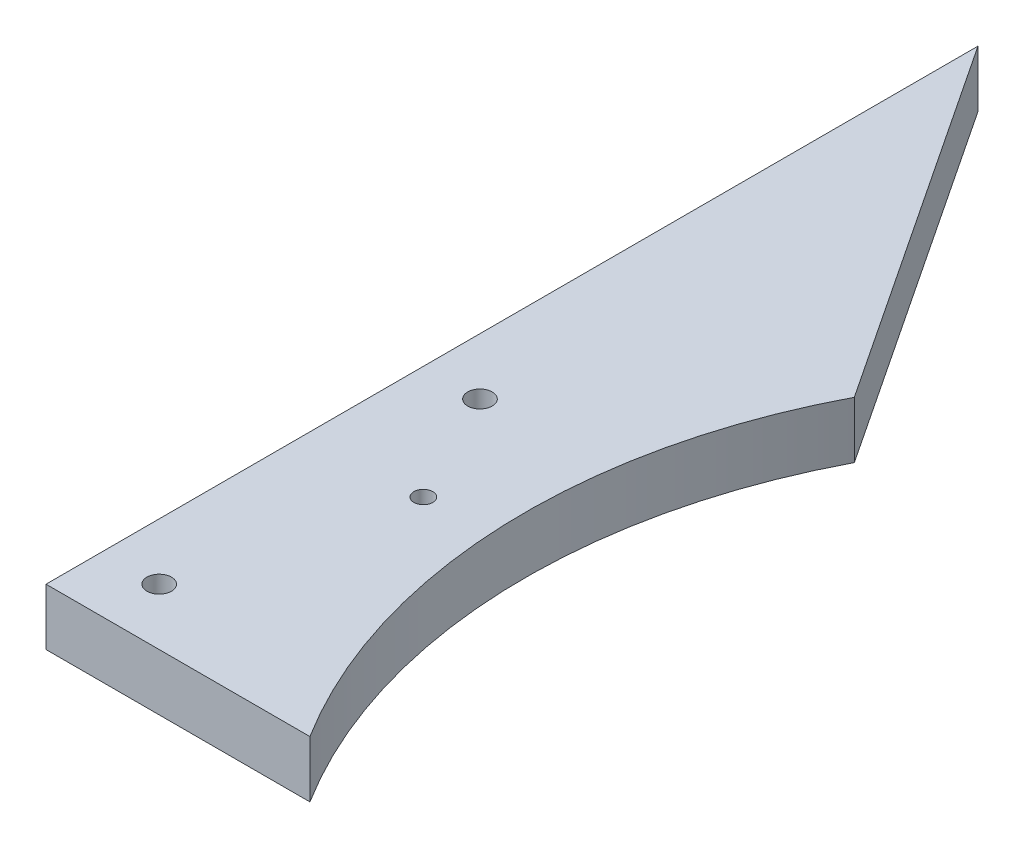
ISO-10303-21;
HEADER;
FILE_DESCRIPTION(('STEP AP214'),'2;1');
FILE_NAME('part.step','',(''),(''),'','','');
FILE_SCHEMA(('AUTOMOTIVE_DESIGN { 1 0 10303 214 1 1 1 1 }'));
ENDSEC;
DATA;
#1=APPLICATION_CONTEXT('core data for automotive mechanical design processes');
#2=APPLICATION_PROTOCOL_DEFINITION('international standard','automotive_design',2000,#1);
#3=PRODUCT_CONTEXT('',#1,'mechanical');
#4=PRODUCT('Part','Part','',(#3));
#5=PRODUCT_RELATED_PRODUCT_CATEGORY('part','',(#4));
#6=PRODUCT_DEFINITION_FORMATION('','',#4);
#7=PRODUCT_DEFINITION_CONTEXT('part definition',#1,'design');
#8=PRODUCT_DEFINITION('design','',#6,#7);
#9=PRODUCT_DEFINITION_SHAPE('','',#8);
#10=(LENGTH_UNIT() NAMED_UNIT(*) SI_UNIT(.MILLI.,.METRE.));
#11=(NAMED_UNIT(*) PLANE_ANGLE_UNIT() SI_UNIT($,.RADIAN.));
#12=(NAMED_UNIT(*) SI_UNIT($,.STERADIAN.) SOLID_ANGLE_UNIT());
#13=UNCERTAINTY_MEASURE_WITH_UNIT(LENGTH_MEASURE(1.E-05),#10,'distance_accuracy_value','');
#14=(GEOMETRIC_REPRESENTATION_CONTEXT(3) GLOBAL_UNCERTAINTY_ASSIGNED_CONTEXT((#13)) GLOBAL_UNIT_ASSIGNED_CONTEXT((#10,
#11,#12)) REPRESENTATION_CONTEXT('',''));
#15=CARTESIAN_POINT('',(0.,0.,0.));
#16=DIRECTION('',(0.,0.,1.));
#17=DIRECTION('',(1.,0.,0.));
#18=AXIS2_PLACEMENT_3D('',#15,#16,#17);
#19=CARTESIAN_POINT('',(-83.,6.5,40.));
#20=DIRECTION('',(0.,-1.,0.));
#21=DIRECTION('',(0.,0.,-1.));
#22=AXIS2_PLACEMENT_3D('',#19,#20,#21);
#23=CYLINDRICAL_SURFACE('',#22,5.50000000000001);
#24=CARTESIAN_POINT('',(-83.,6.5,40.));
#25=DIRECTION('',(0.,-1.,0.));
#26=DIRECTION('',(0.,0.,-1.));
#27=AXIS2_PLACEMENT_3D('',#24,#25,#26);
#28=CIRCLE('',#27,5.50000000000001);
#29=CARTESIAN_POINT('',(-83.,6.5,34.5));
#30=VERTEX_POINT('',#29);
#31=EDGE_CURVE('E20',#30,#30,#28,.T.);
#32=ORIENTED_EDGE('',*,*,#31,.F.);
#33=EDGE_LOOP('',(#32));
#34=FACE_BOUND('',#33,.T.);
#35=CARTESIAN_POINT('',(-83.,0.,40.));
#36=DIRECTION('',(0.,-1.,0.));
#37=DIRECTION('',(0.,0.,-1.));
#38=AXIS2_PLACEMENT_3D('',#35,#36,#37);
#39=CIRCLE('',#38,5.50000000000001);
#40=CARTESIAN_POINT('',(-83.,0.,34.5));
#41=VERTEX_POINT('',#40);
#42=EDGE_CURVE('E121',#41,#41,#39,.T.);
#43=ORIENTED_EDGE('',*,*,#42,.T.);
#44=EDGE_LOOP('',(#43));
#45=FACE_BOUND('',#44,.T.);
#46=ADVANCED_FACE('F17',(#34,#45),#23,.F.);
#47=CARTESIAN_POINT('',(-83.,6.5,125.));
#48=DIRECTION('',(0.,-1.,0.));
#49=DIRECTION('',(0.,0.,-1.));
#50=AXIS2_PLACEMENT_3D('',#47,#48,#49);
#51=CYLINDRICAL_SURFACE('',#50,5.50000000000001);
#52=CARTESIAN_POINT('',(-83.,6.5,125.));
#53=DIRECTION('',(0.,-1.,0.));
#54=DIRECTION('',(0.,0.,-1.));
#55=AXIS2_PLACEMENT_3D('',#52,#53,#54);
#56=CIRCLE('',#55,5.50000000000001);
#57=CARTESIAN_POINT('',(-83.,6.5,119.5));
#58=VERTEX_POINT('',#57);
#59=EDGE_CURVE('E123',#58,#58,#56,.T.);
#60=ORIENTED_EDGE('',*,*,#59,.F.);
#61=EDGE_LOOP('',(#60));
#62=FACE_BOUND('',#61,.T.);
#63=CARTESIAN_POINT('',(-83.,0.,125.));
#64=DIRECTION('',(0.,-1.,0.));
#65=DIRECTION('',(0.,0.,-1.));
#66=AXIS2_PLACEMENT_3D('',#63,#64,#65);
#67=CIRCLE('',#66,5.50000000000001);
#68=CARTESIAN_POINT('',(-83.,0.,119.5));
#69=VERTEX_POINT('',#68);
#70=EDGE_CURVE('E118',#69,#69,#67,.T.);
#71=ORIENTED_EDGE('',*,*,#70,.T.);
#72=EDGE_LOOP('',(#71));
#73=FACE_BOUND('',#72,.T.);
#74=ADVANCED_FACE('F134',(#62,#73),#51,.F.);
#75=CARTESIAN_POINT('',(-83.,6.5,40.));
#76=DIRECTION('',(0.,-1.,0.));
#77=DIRECTION('',(0.,0.,-1.));
#78=AXIS2_PLACEMENT_3D('',#75,#76,#77);
#79=PLANE('',#78);
#80=CARTESIAN_POINT('',(-83.,6.5,40.));
#81=DIRECTION('',(0.,-1.,0.));
#82=DIRECTION('',(0.,0.,-1.));
#83=AXIS2_PLACEMENT_3D('',#80,#81,#82);
#84=CIRCLE('',#83,3.25000000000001);
#85=CARTESIAN_POINT('',(-83.,6.5,36.7499999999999));
#86=VERTEX_POINT('',#85);
#87=EDGE_CURVE('E112',#86,#86,#84,.F.);
#88=ORIENTED_EDGE('',*,*,#87,.T.);
#89=EDGE_LOOP('',(#88));
#90=FACE_BOUND('',#89,.T.);
#91=ORIENTED_EDGE('',*,*,#31,.T.);
#92=EDGE_LOOP('',(#91));
#93=FACE_BOUND('',#92,.T.);
#94=ADVANCED_FACE('F130',(#90,#93),#79,.T.);
#95=CARTESIAN_POINT('',(-83.,6.5,125.));
#96=DIRECTION('',(0.,-1.,0.));
#97=DIRECTION('',(0.,0.,-1.));
#98=AXIS2_PLACEMENT_3D('',#95,#96,#97);
#99=PLANE('',#98);
#100=CARTESIAN_POINT('',(-83.,6.5,125.));
#101=DIRECTION('',(0.,-1.,0.));
#102=DIRECTION('',(0.,0.,-1.));
#103=AXIS2_PLACEMENT_3D('',#100,#101,#102);
#104=CIRCLE('',#103,3.25);
#105=CARTESIAN_POINT('',(-83.,6.5,121.75));
#106=VERTEX_POINT('',#105);
#107=EDGE_CURVE('E74',#106,#106,#104,.F.);
#108=ORIENTED_EDGE('',*,*,#107,.T.);
#109=EDGE_LOOP('',(#108));
#110=FACE_BOUND('',#109,.T.);
#111=ORIENTED_EDGE('',*,*,#59,.T.);
#112=EDGE_LOOP('',(#111));
#113=FACE_BOUND('',#112,.T.);
#114=ADVANCED_FACE('F140',(#110,#113),#99,.T.);
#115=CARTESIAN_POINT('',(0.,0.,0.));
#116=DIRECTION('',(0.,1.,0.));
#117=DIRECTION('',(0.,0.,1.));
#118=AXIS2_PLACEMENT_3D('',#115,#116,#117);
#119=PLANE('',#118);
#120=DIRECTION('',(-1.,0.,0.));
#121=VECTOR('',#120,1.);
#122=CARTESIAN_POINT('',(80.,0.,140.));
#123=LINE('',#122,#121);
#124=CARTESIAN_POINT('',(-28.0663890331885,0.,140.));
#125=VERTEX_POINT('',#124);
#126=CARTESIAN_POINT('',(-98.,0.,140.));
#127=VERTEX_POINT('',#126);
#128=EDGE_CURVE('E61',#125,#127,#123,.T.);
#129=ORIENTED_EDGE('',*,*,#128,.T.);
#130=DIRECTION('',(0.,0.,-1.));
#131=VECTOR('',#130,1.);
#132=CARTESIAN_POINT('',(-98.,0.,250.));
#133=LINE('',#132,#131);
#134=CARTESIAN_POINT('',(-98.,0.,-106.979097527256));
#135=VERTEX_POINT('',#134);
#136=EDGE_CURVE('E88',#127,#135,#133,.T.);
#137=ORIENTED_EDGE('',*,*,#136,.T.);
#138=DIRECTION('',(0.552034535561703,0.,0.833821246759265));
#139=VECTOR('',#138,1.);
#140=CARTESIAN_POINT('',(-100.,0.,-110.));
#141=LINE('',#140,#139);
#142=CARTESIAN_POINT('',(-33.7946187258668,0.,-9.99999999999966));
#143=VERTEX_POINT('',#142);
#144=EDGE_CURVE('E63',#135,#143,#141,.T.);
#145=ORIENTED_EDGE('',*,*,#144,.T.);
#146=CARTESIAN_POINT('',(100.,0.,59.9999999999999));
#147=DIRECTION('',(0.,1.,0.));
#148=DIRECTION('',(0.,0.,1.));
#149=AXIS2_PLACEMENT_3D('',#146,#147,#148);
#150=CIRCLE('',#149,151.);
#151=EDGE_CURVE('E54',#143,#125,#150,.T.);
#152=ORIENTED_EDGE('',*,*,#151,.T.);
#153=EDGE_LOOP('',(#129,#137,#145,#152));
#154=FACE_BOUND('',#153,.T.);
#155=ORIENTED_EDGE('',*,*,#70,.F.);
#156=EDGE_LOOP('',(#155));
#157=FACE_BOUND('',#156,.T.);
#158=ORIENTED_EDGE('',*,*,#42,.F.);
#159=EDGE_LOOP('',(#158));
#160=FACE_BOUND('',#159,.T.);
#161=CARTESIAN_POINT('',(-68.,0.,70.));
#162=DIRECTION('',(0.,1.,0.));
#163=DIRECTION('',(0.,0.,1.));
#164=AXIS2_PLACEMENT_3D('',#161,#162,#163);
#165=CIRCLE('',#164,2.49999999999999);
#166=CARTESIAN_POINT('',(-68.,0.,72.5));
#167=VERTEX_POINT('',#166);
#168=EDGE_CURVE('E115',#167,#167,#165,.T.);
#169=ORIENTED_EDGE('',*,*,#168,.T.);
#170=EDGE_LOOP('',(#169));
#171=FACE_BOUND('',#170,.T.);
#172=ADVANCED_FACE('F58',(#154,#157,#160,#171),#119,.F.);
#173=CARTESIAN_POINT('',(-68.,15.,70.));
#174=DIRECTION('',(0.,1.,0.));
#175=DIRECTION('',(0.,0.,1.));
#176=AXIS2_PLACEMENT_3D('',#173,#174,#175);
#177=CYLINDRICAL_SURFACE('',#176,2.49999999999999);
#178=CARTESIAN_POINT('',(-68.,15.,70.));
#179=DIRECTION('',(0.,1.,0.));
#180=DIRECTION('',(0.,0.,1.));
#181=AXIS2_PLACEMENT_3D('',#178,#179,#180);
#182=CIRCLE('',#181,2.49999999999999);
#183=CARTESIAN_POINT('',(-68.,15.,72.5));
#184=VERTEX_POINT('',#183);
#185=EDGE_CURVE('E94',#184,#184,#182,.F.);
#186=ORIENTED_EDGE('',*,*,#185,.F.);
#187=EDGE_LOOP('',(#186));
#188=FACE_BOUND('',#187,.T.);
#189=ORIENTED_EDGE('',*,*,#168,.F.);
#190=EDGE_LOOP('',(#189));
#191=FACE_BOUND('',#190,.T.);
#192=ADVANCED_FACE('F139',(#188,#191),#177,.F.);
#193=CARTESIAN_POINT('',(-83.,15.,40.));
#194=DIRECTION('',(0.,-1.,0.));
#195=DIRECTION('',(0.,0.,-1.));
#196=AXIS2_PLACEMENT_3D('',#193,#194,#195);
#197=CYLINDRICAL_SURFACE('',#196,3.25000000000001);
#198=ORIENTED_EDGE('',*,*,#87,.F.);
#199=EDGE_LOOP('',(#198));
#200=FACE_BOUND('',#199,.T.);
#201=CARTESIAN_POINT('',(-83.,15.,40.));
#202=DIRECTION('',(0.,-1.,0.));
#203=DIRECTION('',(0.,0.,-1.));
#204=AXIS2_PLACEMENT_3D('',#201,#202,#203);
#205=CIRCLE('',#204,3.25000000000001);
#206=CARTESIAN_POINT('',(-83.,15.,36.7499999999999));
#207=VERTEX_POINT('',#206);
#208=EDGE_CURVE('E105',#207,#207,#205,.T.);
#209=ORIENTED_EDGE('',*,*,#208,.F.);
#210=EDGE_LOOP('',(#209));
#211=FACE_BOUND('',#210,.T.);
#212=ADVANCED_FACE('F145',(#200,#211),#197,.F.);
#213=CARTESIAN_POINT('',(-83.,15.,125.));
#214=DIRECTION('',(0.,-1.,0.));
#215=DIRECTION('',(0.,0.,-1.));
#216=AXIS2_PLACEMENT_3D('',#213,#214,#215);
#217=CYLINDRICAL_SURFACE('',#216,3.25);
#218=ORIENTED_EDGE('',*,*,#107,.F.);
#219=EDGE_LOOP('',(#218));
#220=FACE_BOUND('',#219,.T.);
#221=CARTESIAN_POINT('',(-83.,15.,125.));
#222=DIRECTION('',(0.,-1.,0.));
#223=DIRECTION('',(0.,0.,-1.));
#224=AXIS2_PLACEMENT_3D('',#221,#222,#223);
#225=CIRCLE('',#224,3.25);
#226=CARTESIAN_POINT('',(-83.,15.,121.75));
#227=VERTEX_POINT('',#226);
#228=EDGE_CURVE('E102',#227,#227,#225,.T.);
#229=ORIENTED_EDGE('',*,*,#228,.F.);
#230=EDGE_LOOP('',(#229));
#231=FACE_BOUND('',#230,.T.);
#232=ADVANCED_FACE('F152',(#220,#231),#217,.F.);
#233=CARTESIAN_POINT('',(80.,0.,140.));
#234=DIRECTION('',(0.,0.,-1.));
#235=DIRECTION('',(-1.,0.,0.));
#236=AXIS2_PLACEMENT_3D('',#233,#234,#235);
#237=PLANE('',#236);
#238=DIRECTION('',(0.,1.,0.));
#239=VECTOR('',#238,1.);
#240=CARTESIAN_POINT('',(-98.,0.,140.));
#241=LINE('',#240,#239);
#242=CARTESIAN_POINT('',(-98.,15.,140.));
#243=VERTEX_POINT('',#242);
#244=EDGE_CURVE('E72',#243,#127,#241,.F.);
#245=ORIENTED_EDGE('',*,*,#244,.T.);
#246=ORIENTED_EDGE('',*,*,#128,.F.);
#247=DIRECTION('',(0.,1.,0.));
#248=VECTOR('',#247,1.);
#249=CARTESIAN_POINT('',(-28.0663890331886,0.,140.));
#250=LINE('',#249,#248);
#251=CARTESIAN_POINT('',(-28.0663890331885,15.,140.));
#252=VERTEX_POINT('',#251);
#253=EDGE_CURVE('E65',#125,#252,#250,.T.);
#254=ORIENTED_EDGE('',*,*,#253,.T.);
#255=DIRECTION('',(1.,0.,0.));
#256=VECTOR('',#255,1.);
#257=CARTESIAN_POINT('',(0.,15.,140.));
#258=LINE('',#257,#256);
#259=EDGE_CURVE('E101',#243,#252,#258,.T.);
#260=ORIENTED_EDGE('',*,*,#259,.F.);
#261=EDGE_LOOP('',(#245,#246,#254,#260));
#262=FACE_BOUND('',#261,.T.);
#263=ADVANCED_FACE('F68',(#262),#237,.F.);
#264=CARTESIAN_POINT('',(100.,0.,59.9999999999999));
#265=DIRECTION('',(0.,1.,0.));
#266=DIRECTION('',(0.,0.,1.));
#267=AXIS2_PLACEMENT_3D('',#264,#265,#266);
#268=CYLINDRICAL_SURFACE('',#267,151.);
#269=ORIENTED_EDGE('',*,*,#253,.F.);
#270=ORIENTED_EDGE('',*,*,#151,.F.);
#271=DIRECTION('',(0.,1.,0.));
#272=VECTOR('',#271,1.);
#273=CARTESIAN_POINT('',(-33.7946187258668,0.,-9.99999999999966));
#274=LINE('',#273,#272);
#275=CARTESIAN_POINT('',(-33.7946187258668,15.,-9.99999999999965));
#276=VERTEX_POINT('',#275);
#277=EDGE_CURVE('E80',#143,#276,#274,.T.);
#278=ORIENTED_EDGE('',*,*,#277,.T.);
#279=CARTESIAN_POINT('',(100.,15.,59.9999999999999));
#280=DIRECTION('',(0.,1.,0.));
#281=DIRECTION('',(0.,0.,1.));
#282=AXIS2_PLACEMENT_3D('',#279,#280,#281);
#283=CIRCLE('',#282,151.);
#284=EDGE_CURVE('E78',#252,#276,#283,.F.);
#285=ORIENTED_EDGE('',*,*,#284,.F.);
#286=EDGE_LOOP('',(#269,#270,#278,#285));
#287=FACE_BOUND('',#286,.T.);
#288=ADVANCED_FACE('F76',(#287),#268,.F.);
#289=CARTESIAN_POINT('',(-100.,0.,-110.));
#290=DIRECTION('',(-0.833821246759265,0.,0.552034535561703));
#291=DIRECTION('',(0.552034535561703,0.,0.833821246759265));
#292=AXIS2_PLACEMENT_3D('',#289,#290,#291);
#293=PLANE('',#292);
#294=DIRECTION('',(0.,1.,0.));
#295=VECTOR('',#294,1.);
#296=CARTESIAN_POINT('',(-98.,0.,-106.979097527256));
#297=LINE('',#296,#295);
#298=CARTESIAN_POINT('',(-98.,15.,-106.979097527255));
#299=VERTEX_POINT('',#298);
#300=EDGE_CURVE('E35',#135,#299,#297,.T.);
#301=ORIENTED_EDGE('',*,*,#300,.T.);
#302=DIRECTION('',(-0.552034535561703,0.,-0.833821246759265));
#303=VECTOR('',#302,1.);
#304=CARTESIAN_POINT('',(-33.7946187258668,15.,-9.99999999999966));
#305=LINE('',#304,#303);
#306=EDGE_CURVE('E26',#276,#299,#305,.T.);
#307=ORIENTED_EDGE('',*,*,#306,.F.);
#308=ORIENTED_EDGE('',*,*,#277,.F.);
#309=ORIENTED_EDGE('',*,*,#144,.F.);
#310=EDGE_LOOP('',(#301,#307,#308,#309));
#311=FACE_BOUND('',#310,.T.);
#312=ADVANCED_FACE('F164',(#311),#293,.F.);
#313=CARTESIAN_POINT('',(-98.,0.,250.));
#314=DIRECTION('',(1.,0.,0.));
#315=DIRECTION('',(0.,0.,-1.));
#316=AXIS2_PLACEMENT_3D('',#313,#314,#315);
#317=PLANE('',#316);
#318=ORIENTED_EDGE('',*,*,#244,.F.);
#319=DIRECTION('',(0.,0.,1.));
#320=VECTOR('',#319,1.);
#321=CARTESIAN_POINT('',(-98.,15.,0.));
#322=LINE('',#321,#320);
#323=EDGE_CURVE('E11',#299,#243,#322,.T.);
#324=ORIENTED_EDGE('',*,*,#323,.F.);
#325=ORIENTED_EDGE('',*,*,#300,.F.);
#326=ORIENTED_EDGE('',*,*,#136,.F.);
#327=EDGE_LOOP('',(#318,#324,#325,#326));
#328=FACE_BOUND('',#327,.T.);
#329=ADVANCED_FACE('F158',(#328),#317,.F.);
#330=CARTESIAN_POINT('',(0.,15.,0.));
#331=DIRECTION('',(0.,1.,0.));
#332=DIRECTION('',(0.,0.,1.));
#333=AXIS2_PLACEMENT_3D('',#330,#331,#332);
#334=PLANE('',#333);
#335=ORIENTED_EDGE('',*,*,#306,.T.);
#336=ORIENTED_EDGE('',*,*,#323,.T.);
#337=ORIENTED_EDGE('',*,*,#259,.T.);
#338=ORIENTED_EDGE('',*,*,#284,.T.);
#339=EDGE_LOOP('',(#335,#336,#337,#338));
#340=FACE_BOUND('',#339,.T.);
#341=ORIENTED_EDGE('',*,*,#228,.T.);
#342=EDGE_LOOP('',(#341));
#343=FACE_BOUND('',#342,.T.);
#344=ORIENTED_EDGE('',*,*,#208,.T.);
#345=EDGE_LOOP('',(#344));
#346=FACE_BOUND('',#345,.T.);
#347=ORIENTED_EDGE('',*,*,#185,.T.);
#348=EDGE_LOOP('',(#347));
#349=FACE_BOUND('',#348,.T.);
#350=ADVANCED_FACE('F156',(#340,#343,#346,#349),#334,.T.);
#351=CLOSED_SHELL('',(#46,#74,#94,#114,#172,#192,#212,#232,#263,#288,#312,#329,#350));
#352=MANIFOLD_SOLID_BREP('B1',#351);
#353=ADVANCED_BREP_SHAPE_REPRESENTATION('',(#18,#352),#14);
#354=SHAPE_DEFINITION_REPRESENTATION(#9,#353);
ENDSEC;
END-ISO-10303-21;
